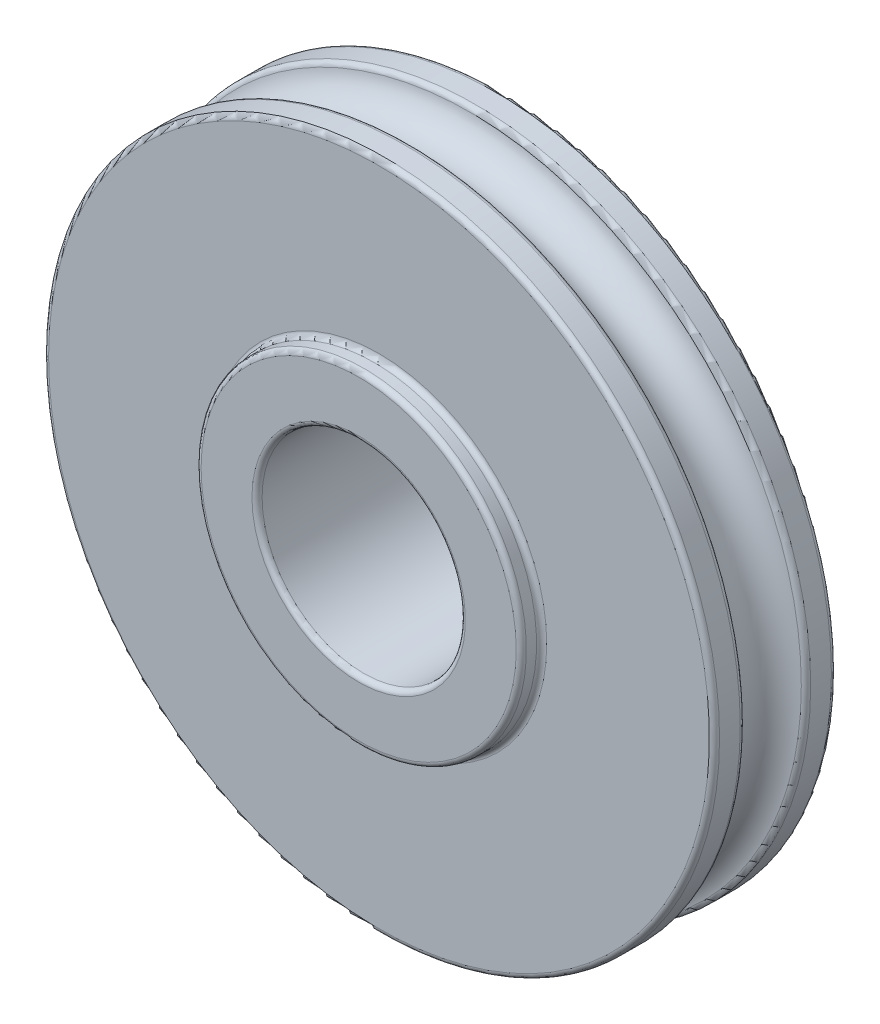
from build123d import *

# Parameters (mm, degrees)
FILLET_1_R = 0.25


with BuildPart() as part:
    # Sketch 1 → Revolve 1 (revolve)
    with BuildSketch(Plane(origin=(0, 0, 0), x_dir=(0, 0, -1), z_dir=(1, 0, 0)), mode=Mode.PRIVATE) as revolve_1_sk:
        with BuildLine():
            Line((-1.5, 16.5), (-3, 16.5))
            Line((-3, 16.5), (-3, 8))
            Line((-3, 8), (-4, 8))
            Line((-4, 8), (-4, 5))
            Line((-4, 5), (4, 5))
            Line((4, 5), (4, 8))
            Line((4, 8), (3, 8))
            Line((3, 8), (3, 16.5))
            Line((3, 16.5), (1.5, 16.5))
            ThreePointArc((1.5, 16.5), (0, 15), (-1.5, 16.5))
        make_face()
    revolve(revolve_1_sk.sketch.rotate(Axis((0, 0, 4), (0, 0, -1)), 90), axis=Axis((0, 0, 4), (0, 0, -1)))

    # Fillet 1
    fillet_1_edges = [part.edges().sort_by_distance(p)[0] for p in [
        (-8, 0, 3),
        (-16.5, 0, 3),
        (-16.5, 0, 1.5),
        (-16.5, 0, -1.5),
        (-16.5, 0, -3),
        (-8, 0, -3),
        (-8, 0, -4),
        (-5, 0, -4),
        (-5, 0, 4),
        (-8, 0, 4),
    ]]
    fillet(fillet_1_edges, radius=FILLET_1_R)


solid = part.part
